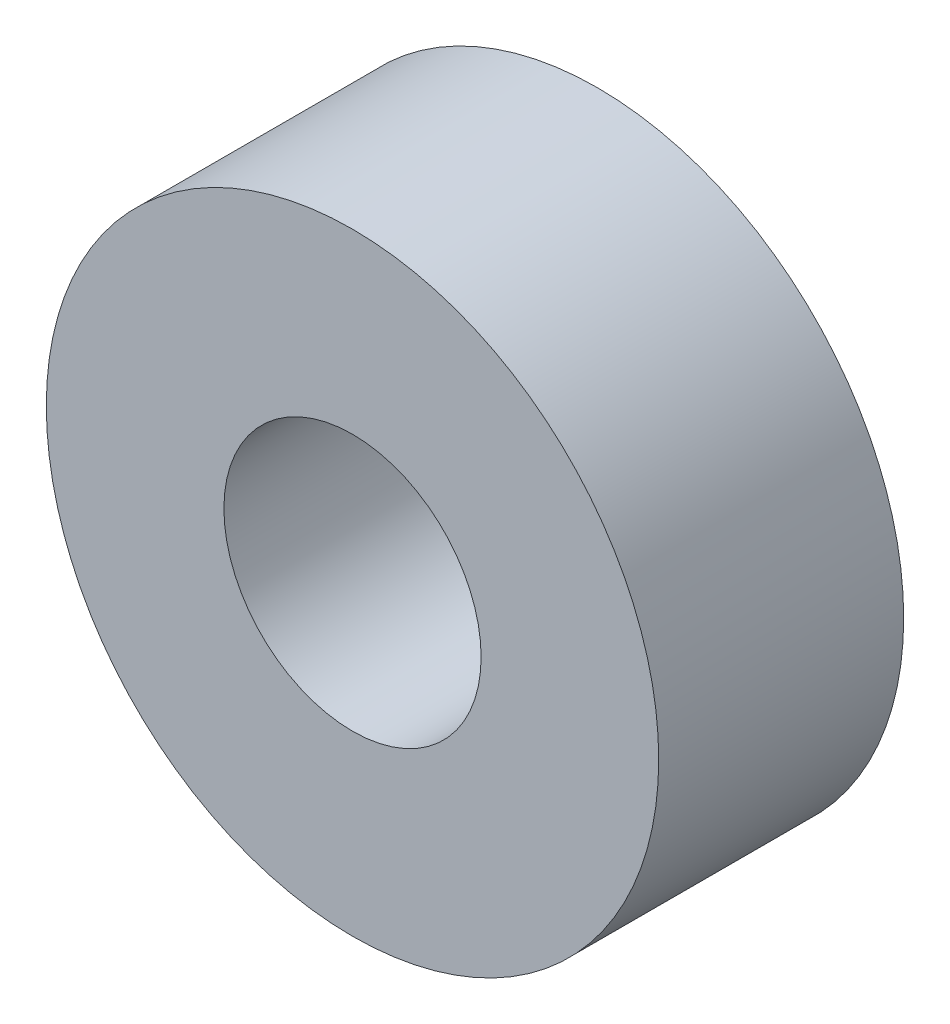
ISO-10303-21;
HEADER;
FILE_DESCRIPTION(('STEP AP214'),'2;1');
FILE_NAME('part.step','',(''),(''),'','','');
FILE_SCHEMA(('AUTOMOTIVE_DESIGN { 1 0 10303 214 1 1 1 1 }'));
ENDSEC;
DATA;
#1=APPLICATION_CONTEXT('core data for automotive mechanical design processes');
#2=APPLICATION_PROTOCOL_DEFINITION('international standard','automotive_design',2000,#1);
#3=PRODUCT_CONTEXT('',#1,'mechanical');
#4=PRODUCT('Part','Part','',(#3));
#5=PRODUCT_RELATED_PRODUCT_CATEGORY('part','',(#4));
#6=PRODUCT_DEFINITION_FORMATION('','',#4);
#7=PRODUCT_DEFINITION_CONTEXT('part definition',#1,'design');
#8=PRODUCT_DEFINITION('design','',#6,#7);
#9=PRODUCT_DEFINITION_SHAPE('','',#8);
#10=(LENGTH_UNIT() NAMED_UNIT(*) SI_UNIT(.MILLI.,.METRE.));
#11=(NAMED_UNIT(*) PLANE_ANGLE_UNIT() SI_UNIT($,.RADIAN.));
#12=(NAMED_UNIT(*) SI_UNIT($,.STERADIAN.) SOLID_ANGLE_UNIT());
#13=UNCERTAINTY_MEASURE_WITH_UNIT(LENGTH_MEASURE(1.E-05),#10,'distance_accuracy_value','');
#14=(GEOMETRIC_REPRESENTATION_CONTEXT(3) GLOBAL_UNCERTAINTY_ASSIGNED_CONTEXT((#13)) GLOBAL_UNIT_ASSIGNED_CONTEXT((#10,
#11,#12)) REPRESENTATION_CONTEXT('',''));
#15=CARTESIAN_POINT('',(0.,0.,0.));
#16=DIRECTION('',(0.,0.,1.));
#17=DIRECTION('',(1.,0.,0.));
#18=AXIS2_PLACEMENT_3D('',#15,#16,#17);
#19=CARTESIAN_POINT('',(0.,0.,20.));
#20=DIRECTION('',(0.,0.,-1.));
#21=DIRECTION('',(-1.,0.,0.));
#22=AXIS2_PLACEMENT_3D('',#19,#20,#21);
#23=CYLINDRICAL_SURFACE('',#22,25.);
#24=CARTESIAN_POINT('',(0.,0.,20.));
#25=DIRECTION('',(0.,0.,1.));
#26=DIRECTION('',(1.,0.,0.));
#27=AXIS2_PLACEMENT_3D('',#24,#25,#26);
#28=CIRCLE('',#27,25.);
#29=CARTESIAN_POINT('',(25.,0.,20.));
#30=VERTEX_POINT('',#29);
#31=EDGE_CURVE('E12',#30,#30,#28,.T.);
#32=ORIENTED_EDGE('',*,*,#31,.F.);
#33=EDGE_LOOP('',(#32));
#34=FACE_BOUND('',#33,.T.);
#35=CARTESIAN_POINT('',(0.,0.,0.));
#36=DIRECTION('',(0.,0.,1.));
#37=DIRECTION('',(1.,0.,0.));
#38=AXIS2_PLACEMENT_3D('',#35,#36,#37);
#39=CIRCLE('',#38,25.);
#40=CARTESIAN_POINT('',(25.,0.,0.));
#41=VERTEX_POINT('',#40);
#42=EDGE_CURVE('E52',#41,#41,#39,.T.);
#43=ORIENTED_EDGE('',*,*,#42,.T.);
#44=EDGE_LOOP('',(#43));
#45=FACE_BOUND('',#44,.T.);
#46=ADVANCED_FACE('F49',(#34,#45),#23,.T.);
#47=CARTESIAN_POINT('',(0.,0.,20.));
#48=DIRECTION('',(0.,0.,1.));
#49=DIRECTION('',(1.,0.,0.));
#50=AXIS2_PLACEMENT_3D('',#47,#48,#49);
#51=PLANE('',#50);
#52=CARTESIAN_POINT('',(0.,0.,20.));
#53=DIRECTION('',(0.,0.,1.));
#54=DIRECTION('',(1.,0.,0.));
#55=AXIS2_PLACEMENT_3D('',#52,#53,#54);
#56=CIRCLE('',#55,10.5);
#57=CARTESIAN_POINT('',(10.5,0.,20.));
#58=VERTEX_POINT('',#57);
#59=EDGE_CURVE('E66',#58,#58,#56,.T.);
#60=ORIENTED_EDGE('',*,*,#59,.F.);
#61=EDGE_LOOP('',(#60));
#62=FACE_BOUND('',#61,.T.);
#63=ORIENTED_EDGE('',*,*,#31,.T.);
#64=EDGE_LOOP('',(#63));
#65=FACE_BOUND('',#64,.T.);
#66=ADVANCED_FACE('F73',(#62,#65),#51,.T.);
#67=CARTESIAN_POINT('',(0.,0.,0.));
#68=DIRECTION('',(0.,0.,1.));
#69=DIRECTION('',(1.,0.,0.));
#70=AXIS2_PLACEMENT_3D('',#67,#68,#69);
#71=PLANE('',#70);
#72=CARTESIAN_POINT('',(0.,0.,0.));
#73=DIRECTION('',(0.,0.,1.));
#74=DIRECTION('',(1.,0.,0.));
#75=AXIS2_PLACEMENT_3D('',#72,#73,#74);
#76=CIRCLE('',#75,10.5);
#77=CARTESIAN_POINT('',(10.5,0.,0.));
#78=VERTEX_POINT('',#77);
#79=EDGE_CURVE('E61',#78,#78,#76,.T.);
#80=ORIENTED_EDGE('',*,*,#79,.T.);
#81=EDGE_LOOP('',(#80));
#82=FACE_BOUND('',#81,.T.);
#83=ORIENTED_EDGE('',*,*,#42,.F.);
#84=EDGE_LOOP('',(#83));
#85=FACE_BOUND('',#84,.T.);
#86=ADVANCED_FACE('F75',(#82,#85),#71,.F.);
#87=CARTESIAN_POINT('',(0.,0.,20.));
#88=DIRECTION('',(0.,0.,1.));
#89=DIRECTION('',(1.,0.,0.));
#90=AXIS2_PLACEMENT_3D('',#87,#88,#89);
#91=CYLINDRICAL_SURFACE('',#90,10.5);
#92=ORIENTED_EDGE('',*,*,#79,.F.);
#93=EDGE_LOOP('',(#92));
#94=FACE_BOUND('',#93,.T.);
#95=ORIENTED_EDGE('',*,*,#59,.T.);
#96=EDGE_LOOP('',(#95));
#97=FACE_BOUND('',#96,.T.);
#98=ADVANCED_FACE('F71',(#94,#97),#91,.F.);
#99=CLOSED_SHELL('',(#46,#66,#86,#98));
#100=MANIFOLD_SOLID_BREP('B2',#99);
#101=ADVANCED_BREP_SHAPE_REPRESENTATION('',(#18,#100),#14);
#102=SHAPE_DEFINITION_REPRESENTATION(#9,#101);
ENDSEC;
END-ISO-10303-21;
